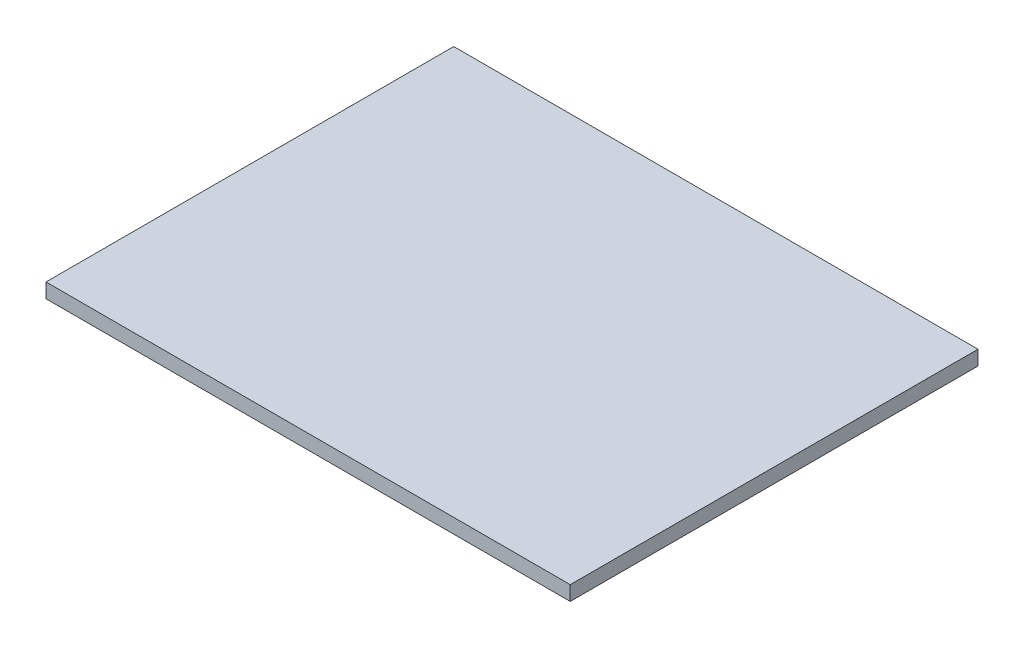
ISO-10303-21;
HEADER;
FILE_DESCRIPTION(('STEP AP214'),'2;1');
FILE_NAME('part.step','',(''),(''),'','','');
FILE_SCHEMA(('AUTOMOTIVE_DESIGN { 1 0 10303 214 1 1 1 1 }'));
ENDSEC;
DATA;
#1=APPLICATION_CONTEXT('core data for automotive mechanical design processes');
#2=APPLICATION_PROTOCOL_DEFINITION('international standard','automotive_design',2000,#1);
#3=PRODUCT_CONTEXT('',#1,'mechanical');
#4=PRODUCT('Part','Part','',(#3));
#5=PRODUCT_RELATED_PRODUCT_CATEGORY('part','',(#4));
#6=PRODUCT_DEFINITION_FORMATION('','',#4);
#7=PRODUCT_DEFINITION_CONTEXT('part definition',#1,'design');
#8=PRODUCT_DEFINITION('design','',#6,#7);
#9=PRODUCT_DEFINITION_SHAPE('','',#8);
#10=(LENGTH_UNIT() NAMED_UNIT(*) SI_UNIT(.MILLI.,.METRE.));
#11=(NAMED_UNIT(*) PLANE_ANGLE_UNIT() SI_UNIT($,.RADIAN.));
#12=(NAMED_UNIT(*) SI_UNIT($,.STERADIAN.) SOLID_ANGLE_UNIT());
#13=UNCERTAINTY_MEASURE_WITH_UNIT(LENGTH_MEASURE(1.E-05),#10,'distance_accuracy_value','');
#14=(GEOMETRIC_REPRESENTATION_CONTEXT(3) GLOBAL_UNCERTAINTY_ASSIGNED_CONTEXT((#13)) GLOBAL_UNIT_ASSIGNED_CONTEXT((#10,
#11,#12)) REPRESENTATION_CONTEXT('',''));
#15=CARTESIAN_POINT('',(0.,0.,0.));
#16=DIRECTION('',(0.,0.,1.));
#17=DIRECTION('',(1.,0.,0.));
#18=AXIS2_PLACEMENT_3D('',#15,#16,#17);
#19=CARTESIAN_POINT('',(0.,3.,0.));
#20=DIRECTION('',(1.,0.,0.));
#21=DIRECTION('',(0.,0.,-1.));
#22=AXIS2_PLACEMENT_3D('',#19,#20,#21);
#23=PLANE('',#22);
#24=DIRECTION('',(0.,0.,1.));
#25=VECTOR('',#24,1.);
#26=CARTESIAN_POINT('',(0.,0.,0.));
#27=LINE('',#26,#25);
#28=CARTESIAN_POINT('',(0.,0.,-84.));
#29=VERTEX_POINT('',#28);
#30=CARTESIAN_POINT('',(0.,0.,0.));
#31=VERTEX_POINT('',#30);
#32=EDGE_CURVE('E113',#29,#31,#27,.T.);
#33=ORIENTED_EDGE('',*,*,#32,.T.);
#34=DIRECTION('',(0.,-1.,0.));
#35=VECTOR('',#34,1.);
#36=CARTESIAN_POINT('',(0.,3.,0.));
#37=LINE('',#36,#35);
#38=CARTESIAN_POINT('',(0.,3.,0.));
#39=VERTEX_POINT('',#38);
#40=EDGE_CURVE('E11',#39,#31,#37,.T.);
#41=ORIENTED_EDGE('',*,*,#40,.F.);
#42=DIRECTION('',(0.,0.,1.));
#43=VECTOR('',#42,1.);
#44=CARTESIAN_POINT('',(0.,3.,0.));
#45=LINE('',#44,#43);
#46=CARTESIAN_POINT('',(0.,3.,-84.));
#47=VERTEX_POINT('',#46);
#48=EDGE_CURVE('E97',#47,#39,#45,.T.);
#49=ORIENTED_EDGE('',*,*,#48,.F.);
#50=DIRECTION('',(0.,-1.,0.));
#51=VECTOR('',#50,1.);
#52=CARTESIAN_POINT('',(0.,3.,-84.));
#53=LINE('',#52,#51);
#54=EDGE_CURVE('E109',#47,#29,#53,.T.);
#55=ORIENTED_EDGE('',*,*,#54,.T.);
#56=EDGE_LOOP('',(#33,#41,#49,#55));
#57=FACE_BOUND('',#56,.T.);
#58=ADVANCED_FACE('F45',(#57),#23,.F.);
#59=CARTESIAN_POINT('',(0.,3.,0.));
#60=DIRECTION('',(0.,0.,-1.));
#61=DIRECTION('',(-1.,0.,0.));
#62=AXIS2_PLACEMENT_3D('',#59,#60,#61);
#63=PLANE('',#62);
#64=DIRECTION('',(1.,0.,0.));
#65=VECTOR('',#64,1.);
#66=CARTESIAN_POINT('',(0.,0.,0.));
#67=LINE('',#66,#65);
#68=CARTESIAN_POINT('',(108.,0.,0.));
#69=VERTEX_POINT('',#68);
#70=EDGE_CURVE('E102',#31,#69,#67,.T.);
#71=ORIENTED_EDGE('',*,*,#70,.T.);
#72=DIRECTION('',(0.,-1.,0.));
#73=VECTOR('',#72,1.);
#74=CARTESIAN_POINT('',(108.,3.,0.));
#75=LINE('',#74,#73);
#76=CARTESIAN_POINT('',(108.,3.,0.));
#77=VERTEX_POINT('',#76);
#78=EDGE_CURVE('E54',#77,#69,#75,.T.);
#79=ORIENTED_EDGE('',*,*,#78,.F.);
#80=DIRECTION('',(1.,0.,0.));
#81=VECTOR('',#80,1.);
#82=CARTESIAN_POINT('',(0.,3.,0.));
#83=LINE('',#82,#81);
#84=EDGE_CURVE('E92',#39,#77,#83,.T.);
#85=ORIENTED_EDGE('',*,*,#84,.F.);
#86=ORIENTED_EDGE('',*,*,#40,.T.);
#87=EDGE_LOOP('',(#71,#79,#85,#86));
#88=FACE_BOUND('',#87,.T.);
#89=ADVANCED_FACE('F101',(#88),#63,.F.);
#90=CARTESIAN_POINT('',(108.,3.,0.));
#91=DIRECTION('',(-1.,0.,0.));
#92=DIRECTION('',(0.,0.,1.));
#93=AXIS2_PLACEMENT_3D('',#90,#91,#92);
#94=PLANE('',#93);
#95=DIRECTION('',(0.,0.,-1.));
#96=VECTOR('',#95,1.);
#97=CARTESIAN_POINT('',(108.,0.,0.));
#98=LINE('',#97,#96);
#99=CARTESIAN_POINT('',(108.,0.,-84.));
#100=VERTEX_POINT('',#99);
#101=EDGE_CURVE('E79',#69,#100,#98,.T.);
#102=ORIENTED_EDGE('',*,*,#101,.T.);
#103=DIRECTION('',(0.,-1.,0.));
#104=VECTOR('',#103,1.);
#105=CARTESIAN_POINT('',(108.,3.,-84.));
#106=LINE('',#105,#104);
#107=CARTESIAN_POINT('',(108.,3.,-84.));
#108=VERTEX_POINT('',#107);
#109=EDGE_CURVE('E104',#108,#100,#106,.T.);
#110=ORIENTED_EDGE('',*,*,#109,.F.);
#111=DIRECTION('',(0.,0.,-1.));
#112=VECTOR('',#111,1.);
#113=CARTESIAN_POINT('',(108.,3.,0.));
#114=LINE('',#113,#112);
#115=EDGE_CURVE('E95',#77,#108,#114,.T.);
#116=ORIENTED_EDGE('',*,*,#115,.F.);
#117=ORIENTED_EDGE('',*,*,#78,.T.);
#118=EDGE_LOOP('',(#102,#110,#116,#117));
#119=FACE_BOUND('',#118,.T.);
#120=ADVANCED_FACE('F105',(#119),#94,.F.);
#121=CARTESIAN_POINT('',(0.,3.,-84.));
#122=DIRECTION('',(0.,0.,1.));
#123=DIRECTION('',(1.,0.,0.));
#124=AXIS2_PLACEMENT_3D('',#121,#122,#123);
#125=PLANE('',#124);
#126=DIRECTION('',(-1.,0.,0.));
#127=VECTOR('',#126,1.);
#128=CARTESIAN_POINT('',(0.,0.,-84.));
#129=LINE('',#128,#127);
#130=EDGE_CURVE('E85',#100,#29,#129,.T.);
#131=ORIENTED_EDGE('',*,*,#130,.T.);
#132=ORIENTED_EDGE('',*,*,#54,.F.);
#133=DIRECTION('',(-1.,0.,0.));
#134=VECTOR('',#133,1.);
#135=CARTESIAN_POINT('',(0.,3.,-84.));
#136=LINE('',#135,#134);
#137=EDGE_CURVE('E62',#108,#47,#136,.T.);
#138=ORIENTED_EDGE('',*,*,#137,.F.);
#139=ORIENTED_EDGE('',*,*,#109,.T.);
#140=EDGE_LOOP('',(#131,#132,#138,#139));
#141=FACE_BOUND('',#140,.T.);
#142=ADVANCED_FACE('F126',(#141),#125,.F.);
#143=CARTESIAN_POINT('',(0.,3.,0.));
#144=DIRECTION('',(0.,-1.,0.));
#145=DIRECTION('',(0.,0.,-1.));
#146=AXIS2_PLACEMENT_3D('',#143,#144,#145);
#147=PLANE('',#146);
#148=ORIENTED_EDGE('',*,*,#48,.T.);
#149=ORIENTED_EDGE('',*,*,#84,.T.);
#150=ORIENTED_EDGE('',*,*,#115,.T.);
#151=ORIENTED_EDGE('',*,*,#137,.T.);
#152=EDGE_LOOP('',(#148,#149,#150,#151));
#153=FACE_BOUND('',#152,.T.);
#154=ADVANCED_FACE('F93',(#153),#147,.F.);
#155=CARTESIAN_POINT('',(0.,0.,0.));
#156=DIRECTION('',(0.,-1.,0.));
#157=DIRECTION('',(0.,0.,-1.));
#158=AXIS2_PLACEMENT_3D('',#155,#156,#157);
#159=PLANE('',#158);
#160=ORIENTED_EDGE('',*,*,#32,.F.);
#161=ORIENTED_EDGE('',*,*,#130,.F.);
#162=ORIENTED_EDGE('',*,*,#101,.F.);
#163=ORIENTED_EDGE('',*,*,#70,.F.);
#164=EDGE_LOOP('',(#160,#161,#162,#163));
#165=FACE_BOUND('',#164,.T.);
#166=ADVANCED_FACE('F129',(#165),#159,.T.);
#167=CLOSED_SHELL('',(#58,#89,#120,#142,#154,#166));
#168=MANIFOLD_SOLID_BREP('B2',#167);
#169=ADVANCED_BREP_SHAPE_REPRESENTATION('',(#18,#168),#14);
#170=SHAPE_DEFINITION_REPRESENTATION(#9,#169);
ENDSEC;
END-ISO-10303-21;
